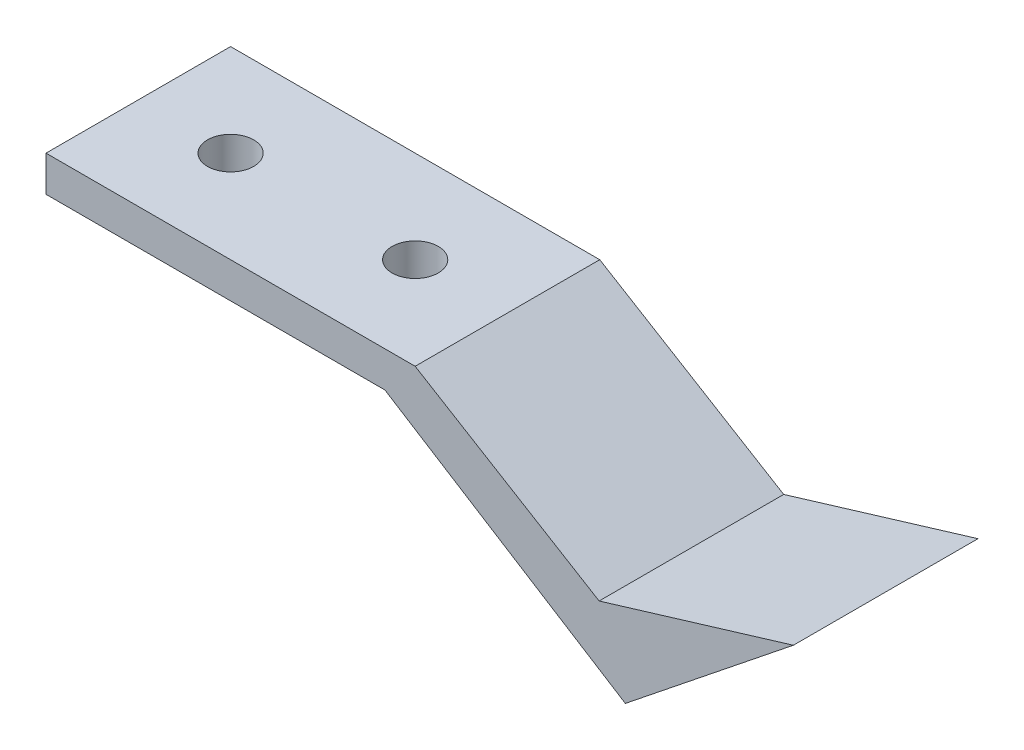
from build123d import *

# Parameters (mm, degrees)
EXTRUDE_1_DEPTH     = 12.7
SKETCH_2_R          = 1.5875
CUT_EXTRUDE_1_DEPTH = 12.7


with BuildPart() as part:
    # Sketch 1 → Extrude 1 (new body)
    with BuildSketch(Plane.XY):
        Polygon((10.618907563, -1.227310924), (27.16092437, -11.632773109), (38.72441312, -2.383499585), (25.357310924, -6.430042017), (12.7, 1.227310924), (-12.7, 1.227310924), (-12.7, -1.227310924), align=None)
    extrude(amount=EXTRUDE_1_DEPTH)

    # Sketch 2 → Cut-Extrude 1 (cut)
    with BuildSketch(Plane(origin=(0, 1.227310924, 0), x_dir=(1, 0, 0), z_dir=(0, 1, 0))):
        with Locations(Location((-6.35, -6.35, 0), (0, 0, 270))):
            Circle(SKETCH_2_R)
        with Locations(Location((6.35, -6.35, 0), (0, 0, 270))):
            Circle(SKETCH_2_R)
    extrude(amount=-CUT_EXTRUDE_1_DEPTH, mode=Mode.SUBTRACT)


solid = part.part
